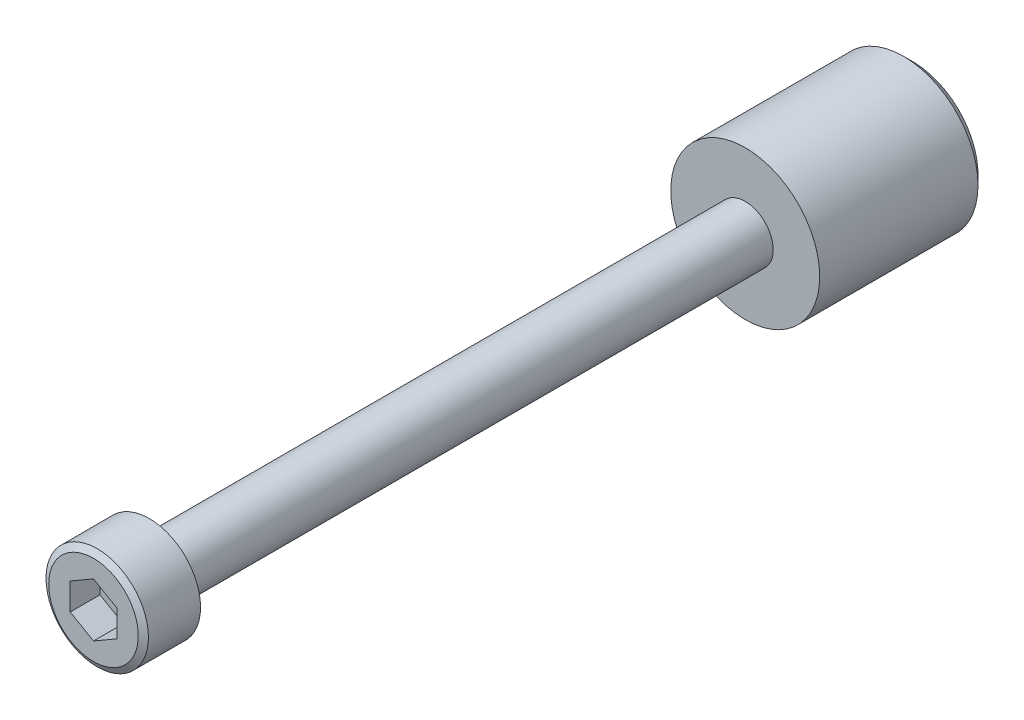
ISO-10303-21;
HEADER;
FILE_DESCRIPTION(('STEP AP214'),'2;1');
FILE_NAME('part.step','',(''),(''),'','','');
FILE_SCHEMA(('AUTOMOTIVE_DESIGN { 1 0 10303 214 1 1 1 1 }'));
ENDSEC;
DATA;
#1=APPLICATION_CONTEXT('core data for automotive mechanical design processes');
#2=APPLICATION_PROTOCOL_DEFINITION('international standard','automotive_design',2000,#1);
#3=PRODUCT_CONTEXT('',#1,'mechanical');
#4=PRODUCT('Part','Part','',(#3));
#5=PRODUCT_RELATED_PRODUCT_CATEGORY('part','',(#4));
#6=PRODUCT_DEFINITION_FORMATION('','',#4);
#7=PRODUCT_DEFINITION_CONTEXT('part definition',#1,'design');
#8=PRODUCT_DEFINITION('design','',#6,#7);
#9=PRODUCT_DEFINITION_SHAPE('','',#8);
#10=(LENGTH_UNIT() NAMED_UNIT(*) SI_UNIT(.MILLI.,.METRE.));
#11=(NAMED_UNIT(*) PLANE_ANGLE_UNIT() SI_UNIT($,.RADIAN.));
#12=(NAMED_UNIT(*) SI_UNIT($,.STERADIAN.) SOLID_ANGLE_UNIT());
#13=UNCERTAINTY_MEASURE_WITH_UNIT(LENGTH_MEASURE(1.E-05),#10,'distance_accuracy_value','');
#14=(GEOMETRIC_REPRESENTATION_CONTEXT(3) GLOBAL_UNCERTAINTY_ASSIGNED_CONTEXT((#13)) GLOBAL_UNIT_ASSIGNED_CONTEXT((#10,
#11,#12)) REPRESENTATION_CONTEXT('',''));
#15=CARTESIAN_POINT('',(0.,0.,0.));
#16=DIRECTION('',(0.,0.,1.));
#17=DIRECTION('',(1.,0.,0.));
#18=AXIS2_PLACEMENT_3D('',#15,#16,#17);
#19=CARTESIAN_POINT('',(4.048,-4.061929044,0.));
#20=DIRECTION('',(0.,0.,-1.));
#21=DIRECTION('',(-1.,0.,0.));
#22=AXIS2_PLACEMENT_3D('',#19,#20,#21);
#23=PLANE('',#22);
#24=CARTESIAN_POINT('',(0.,0.,0.));
#25=DIRECTION('',(0.,0.,-1.));
#26=DIRECTION('',(-1.,0.,0.));
#27=AXIS2_PLACEMENT_3D('',#24,#25,#26);
#28=CIRCLE('',#27,3.5);
#29=CARTESIAN_POINT('',(-3.5,0.,0.));
#30=VERTEX_POINT('',#29);
#31=EDGE_CURVE('E9',#30,#30,#28,.T.);
#32=ORIENTED_EDGE('',*,*,#31,.T.);
#33=EDGE_LOOP('',(#32));
#34=FACE_BOUND('',#33,.T.);
#35=ADVANCED_FACE('F14',(#34),#23,.T.);
#36=CARTESIAN_POINT('',(0.,0.,0.));
#37=DIRECTION('',(0.,0.,1.));
#38=DIRECTION('',(1.,0.,0.));
#39=AXIS2_PLACEMENT_3D('',#36,#37,#38);
#40=CYLINDRICAL_SURFACE('',#39,4.);
#41=CARTESIAN_POINT('',(0.,0.,0.5));
#42=DIRECTION('',(0.,0.,-1.));
#43=DIRECTION('',(-1.,0.,0.));
#44=AXIS2_PLACEMENT_3D('',#41,#42,#43);
#45=CIRCLE('',#44,4.);
#46=CARTESIAN_POINT('',(-4.,0.,0.5));
#47=VERTEX_POINT('',#46);
#48=EDGE_CURVE('E22',#47,#47,#45,.F.);
#49=ORIENTED_EDGE('',*,*,#48,.T.);
#50=EDGE_LOOP('',(#49));
#51=FACE_BOUND('',#50,.T.);
#52=CARTESIAN_POINT('',(0.,0.,9.));
#53=DIRECTION('',(0.,0.,1.));
#54=DIRECTION('',(1.,0.,0.));
#55=AXIS2_PLACEMENT_3D('',#52,#53,#54);
#56=CIRCLE('',#55,4.);
#57=CARTESIAN_POINT('',(4.,0.,9.));
#58=VERTEX_POINT('',#57);
#59=EDGE_CURVE('E116',#58,#58,#56,.T.);
#60=ORIENTED_EDGE('',*,*,#59,.F.);
#61=EDGE_LOOP('',(#60));
#62=FACE_BOUND('',#61,.T.);
#63=ADVANCED_FACE('F141',(#51,#62),#40,.T.);
#64=CARTESIAN_POINT('',(-4.048,-4.061929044,9.));
#65=DIRECTION('',(0.,0.,1.));
#66=DIRECTION('',(1.,0.,0.));
#67=AXIS2_PLACEMENT_3D('',#64,#65,#66);
#68=PLANE('',#67);
#69=CARTESIAN_POINT('',(0.,0.,9.));
#70=DIRECTION('',(0.,0.,1.));
#71=DIRECTION('',(1.,0.,0.));
#72=AXIS2_PLACEMENT_3D('',#69,#70,#71);
#73=CIRCLE('',#72,1.5);
#74=CARTESIAN_POINT('',(1.5,0.,9.));
#75=VERTEX_POINT('',#74);
#76=EDGE_CURVE('E134',#75,#75,#73,.T.);
#77=ORIENTED_EDGE('',*,*,#76,.F.);
#78=EDGE_LOOP('',(#77));
#79=FACE_BOUND('',#78,.T.);
#80=ORIENTED_EDGE('',*,*,#59,.T.);
#81=EDGE_LOOP('',(#80));
#82=FACE_BOUND('',#81,.T.);
#83=ADVANCED_FACE('F176',(#79,#82),#68,.T.);
#84=CARTESIAN_POINT('',(0.,0.,9.));
#85=DIRECTION('',(0.,0.,1.));
#86=DIRECTION('',(1.,0.,0.));
#87=AXIS2_PLACEMENT_3D('',#84,#85,#86);
#88=CYLINDRICAL_SURFACE('',#87,1.5);
#89=ORIENTED_EDGE('',*,*,#76,.T.);
#90=EDGE_LOOP('',(#89));
#91=FACE_BOUND('',#90,.T.);
#92=CARTESIAN_POINT('',(0.,0.,41.));
#93=DIRECTION('',(0.,0.,1.));
#94=DIRECTION('',(1.,0.,0.));
#95=AXIS2_PLACEMENT_3D('',#92,#93,#94);
#96=CIRCLE('',#95,1.5);
#97=CARTESIAN_POINT('',(1.5,0.,41.));
#98=VERTEX_POINT('',#97);
#99=EDGE_CURVE('E131',#98,#98,#96,.T.);
#100=ORIENTED_EDGE('',*,*,#99,.F.);
#101=EDGE_LOOP('',(#100));
#102=FACE_BOUND('',#101,.T.);
#103=ADVANCED_FACE('F179',(#91,#102),#88,.T.);
#104=CARTESIAN_POINT('',(2.783,-2.792576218,41.));
#105=DIRECTION('',(0.,0.,-1.));
#106=DIRECTION('',(-1.,0.,0.));
#107=AXIS2_PLACEMENT_3D('',#104,#105,#106);
#108=PLANE('',#107);
#109=ORIENTED_EDGE('',*,*,#99,.T.);
#110=EDGE_LOOP('',(#109));
#111=FACE_BOUND('',#110,.T.);
#112=CARTESIAN_POINT('',(0.,0.,41.));
#113=DIRECTION('',(0.,0.,1.));
#114=DIRECTION('',(1.,0.,0.));
#115=AXIS2_PLACEMENT_3D('',#112,#113,#114);
#116=CIRCLE('',#115,2.75);
#117=CARTESIAN_POINT('',(2.75,0.,41.));
#118=VERTEX_POINT('',#117);
#119=EDGE_CURVE('E128',#118,#118,#116,.T.);
#120=ORIENTED_EDGE('',*,*,#119,.F.);
#121=EDGE_LOOP('',(#120));
#122=FACE_BOUND('',#121,.T.);
#123=ADVANCED_FACE('F181',(#111,#122),#108,.T.);
#124=CARTESIAN_POINT('',(-2.432432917,-2.440802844,44.));
#125=DIRECTION('',(0.,0.,1.));
#126=DIRECTION('',(1.,0.,0.));
#127=AXIS2_PLACEMENT_3D('',#124,#125,#126);
#128=PLANE('',#127);
#129=DIRECTION('',(-0.866025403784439,0.5,0.));
#130=VECTOR('',#129,1.);
#131=CARTESIAN_POINT('',(1.25,0.721687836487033,44.));
#132=LINE('',#131,#130);
#133=CARTESIAN_POINT('',(1.25,0.721687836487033,44.));
#134=VERTEX_POINT('',#133);
#135=CARTESIAN_POINT('',(0.,1.44337567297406,44.));
#136=VERTEX_POINT('',#135);
#137=EDGE_CURVE('E29',#134,#136,#132,.T.);
#138=ORIENTED_EDGE('',*,*,#137,.F.);
#139=DIRECTION('',(0.,1.,0.));
#140=VECTOR('',#139,1.);
#141=CARTESIAN_POINT('',(1.25,-0.721687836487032,44.));
#142=LINE('',#141,#140);
#143=CARTESIAN_POINT('',(1.25,-0.721687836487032,44.));
#144=VERTEX_POINT('',#143);
#145=EDGE_CURVE('E112',#144,#134,#142,.T.);
#146=ORIENTED_EDGE('',*,*,#145,.F.);
#147=DIRECTION('',(0.866025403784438,0.5,0.));
#148=VECTOR('',#147,1.);
#149=CARTESIAN_POINT('',(0.,-1.44337567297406,44.));
#150=LINE('',#149,#148);
#151=CARTESIAN_POINT('',(0.,-1.44337567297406,44.));
#152=VERTEX_POINT('',#151);
#153=EDGE_CURVE('E110',#152,#144,#150,.T.);
#154=ORIENTED_EDGE('',*,*,#153,.F.);
#155=DIRECTION('',(0.866025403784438,-0.5,0.));
#156=VECTOR('',#155,1.);
#157=CARTESIAN_POINT('',(-1.25,-0.721687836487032,44.));
#158=LINE('',#157,#156);
#159=CARTESIAN_POINT('',(-1.25,-0.721687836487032,44.));
#160=VERTEX_POINT('',#159);
#161=EDGE_CURVE('E77',#160,#152,#158,.T.);
#162=ORIENTED_EDGE('',*,*,#161,.F.);
#163=DIRECTION('',(0.,-1.,0.));
#164=VECTOR('',#163,1.);
#165=CARTESIAN_POINT('',(-1.25,0.721687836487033,44.));
#166=LINE('',#165,#164);
#167=CARTESIAN_POINT('',(-1.25,0.721687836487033,44.));
#168=VERTEX_POINT('',#167);
#169=EDGE_CURVE('E106',#168,#160,#166,.T.);
#170=ORIENTED_EDGE('',*,*,#169,.F.);
#171=DIRECTION('',(-0.866025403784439,-0.5,0.));
#172=VECTOR('',#171,1.);
#173=CARTESIAN_POINT('',(0.,1.44337567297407,44.));
#174=LINE('',#173,#172);
#175=EDGE_CURVE('E103',#136,#168,#174,.T.);
#176=ORIENTED_EDGE('',*,*,#175,.F.);
#177=EDGE_LOOP('',(#138,#146,#154,#162,#170,#176));
#178=FACE_BOUND('',#177,.T.);
#179=CARTESIAN_POINT('',(0.,0.,44.));
#180=DIRECTION('',(0.,0.,-1.));
#181=DIRECTION('',(-1.,0.,0.));
#182=AXIS2_PLACEMENT_3D('',#179,#180,#181);
#183=CIRCLE('',#182,2.403589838);
#184=CARTESIAN_POINT('',(-2.403589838,0.,44.));
#185=VERTEX_POINT('',#184);
#186=EDGE_CURVE('E125',#185,#185,#183,.T.);
#187=ORIENTED_EDGE('',*,*,#186,.F.);
#188=EDGE_LOOP('',(#187));
#189=FACE_BOUND('',#188,.T.);
#190=ADVANCED_FACE('F167',(#178,#189),#128,.T.);
#191=CARTESIAN_POINT('',(0.,0.,41.));
#192=DIRECTION('',(0.,0.,1.));
#193=DIRECTION('',(1.,0.,0.));
#194=AXIS2_PLACEMENT_3D('',#191,#192,#193);
#195=CYLINDRICAL_SURFACE('',#194,2.75);
#196=CARTESIAN_POINT('',(0.,0.,43.8));
#197=DIRECTION('',(0.,0.,-1.));
#198=DIRECTION('',(-1.,0.,0.));
#199=AXIS2_PLACEMENT_3D('',#196,#197,#198);
#200=CIRCLE('',#199,2.75);
#201=CARTESIAN_POINT('',(-2.75,0.,43.8));
#202=VERTEX_POINT('',#201);
#203=EDGE_CURVE('E122',#202,#202,#200,.F.);
#204=ORIENTED_EDGE('',*,*,#203,.F.);
#205=EDGE_LOOP('',(#204));
#206=FACE_BOUND('',#205,.T.);
#207=ORIENTED_EDGE('',*,*,#119,.T.);
#208=EDGE_LOOP('',(#207));
#209=FACE_BOUND('',#208,.T.);
#210=ADVANCED_FACE('F157',(#206,#209),#195,.T.);
#211=CARTESIAN_POINT('',(0.,0.,44.));
#212=DIRECTION('',(0.,0.,-1.));
#213=DIRECTION('',(-1.,0.,0.));
#214=AXIS2_PLACEMENT_3D('',#211,#212,#213);
#215=CONICAL_SURFACE('',#214,2.403589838,1.04719755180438);
#216=ORIENTED_EDGE('',*,*,#203,.T.);
#217=EDGE_LOOP('',(#216));
#218=FACE_BOUND('',#217,.T.);
#219=ORIENTED_EDGE('',*,*,#186,.T.);
#220=EDGE_LOOP('',(#219));
#221=FACE_BOUND('',#220,.T.);
#222=ADVANCED_FACE('F154',(#218,#221),#215,.T.);
#223=CARTESIAN_POINT('',(1.25,0.721687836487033,42.4));
#224=DIRECTION('',(0.5,0.866025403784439,0.));
#225=DIRECTION('',(-0.866025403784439,0.5,0.));
#226=AXIS2_PLACEMENT_3D('',#223,#224,#225);
#227=PLANE('',#226);
#228=ORIENTED_EDGE('',*,*,#137,.T.);
#229=DIRECTION('',(0.,0.,1.));
#230=VECTOR('',#229,1.);
#231=CARTESIAN_POINT('',(0.,1.44337567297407,42.4));
#232=LINE('',#231,#230);
#233=CARTESIAN_POINT('',(0.,1.44337567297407,42.4));
#234=VERTEX_POINT('',#233);
#235=EDGE_CURVE('E59',#234,#136,#232,.T.);
#236=ORIENTED_EDGE('',*,*,#235,.F.);
#237=DIRECTION('',(-0.866025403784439,0.5,0.));
#238=VECTOR('',#237,1.);
#239=CARTESIAN_POINT('',(1.25,0.721687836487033,42.4));
#240=LINE('',#239,#238);
#241=CARTESIAN_POINT('',(1.25,0.721687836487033,42.4));
#242=VERTEX_POINT('',#241);
#243=EDGE_CURVE('E114',#242,#234,#240,.T.);
#244=ORIENTED_EDGE('',*,*,#243,.F.);
#245=DIRECTION('',(0.,0.,1.));
#246=VECTOR('',#245,1.);
#247=CARTESIAN_POINT('',(1.25,0.721687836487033,42.4));
#248=LINE('',#247,#246);
#249=EDGE_CURVE('E37',#242,#134,#248,.T.);
#250=ORIENTED_EDGE('',*,*,#249,.T.);
#251=EDGE_LOOP('',(#228,#236,#244,#250));
#252=FACE_BOUND('',#251,.T.);
#253=ADVANCED_FACE('F156',(#252),#227,.F.);
#254=CARTESIAN_POINT('',(1.25,-0.721687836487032,42.4));
#255=DIRECTION('',(1.,0.,0.));
#256=DIRECTION('',(0.,0.,-1.));
#257=AXIS2_PLACEMENT_3D('',#254,#255,#256);
#258=PLANE('',#257);
#259=ORIENTED_EDGE('',*,*,#145,.T.);
#260=ORIENTED_EDGE('',*,*,#249,.F.);
#261=DIRECTION('',(0.,1.,0.));
#262=VECTOR('',#261,1.);
#263=CARTESIAN_POINT('',(1.25,-0.721687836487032,42.4));
#264=LINE('',#263,#262);
#265=CARTESIAN_POINT('',(1.25,-0.721687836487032,42.4));
#266=VERTEX_POINT('',#265);
#267=EDGE_CURVE('E89',#266,#242,#264,.T.);
#268=ORIENTED_EDGE('',*,*,#267,.F.);
#269=DIRECTION('',(0.,0.,1.));
#270=VECTOR('',#269,1.);
#271=CARTESIAN_POINT('',(1.25,-0.721687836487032,42.4));
#272=LINE('',#271,#270);
#273=EDGE_CURVE('E81',#266,#144,#272,.T.);
#274=ORIENTED_EDGE('',*,*,#273,.T.);
#275=EDGE_LOOP('',(#259,#260,#268,#274));
#276=FACE_BOUND('',#275,.T.);
#277=ADVANCED_FACE('F165',(#276),#258,.F.);
#278=CARTESIAN_POINT('',(0.,-1.44337567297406,42.4));
#279=DIRECTION('',(0.5,-0.866025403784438,0.));
#280=DIRECTION('',(0.866025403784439,0.5,0.));
#281=AXIS2_PLACEMENT_3D('',#278,#279,#280);
#282=PLANE('',#281);
#283=ORIENTED_EDGE('',*,*,#153,.T.);
#284=ORIENTED_EDGE('',*,*,#273,.F.);
#285=DIRECTION('',(0.866025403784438,0.5,0.));
#286=VECTOR('',#285,1.);
#287=CARTESIAN_POINT('',(0.,-1.44337567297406,42.4));
#288=LINE('',#287,#286);
#289=CARTESIAN_POINT('',(0.,-1.44337567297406,42.4));
#290=VERTEX_POINT('',#289);
#291=EDGE_CURVE('E85',#290,#266,#288,.T.);
#292=ORIENTED_EDGE('',*,*,#291,.F.);
#293=DIRECTION('',(0.,0.,1.));
#294=VECTOR('',#293,1.);
#295=CARTESIAN_POINT('',(0.,-1.44337567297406,42.4));
#296=LINE('',#295,#294);
#297=EDGE_CURVE('E70',#290,#152,#296,.T.);
#298=ORIENTED_EDGE('',*,*,#297,.T.);
#299=EDGE_LOOP('',(#283,#284,#292,#298));
#300=FACE_BOUND('',#299,.T.);
#301=ADVANCED_FACE('F86',(#300),#282,.F.);
#302=CARTESIAN_POINT('',(-1.25,-0.721687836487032,42.4));
#303=DIRECTION('',(-0.5,-0.866025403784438,0.));
#304=DIRECTION('',(0.866025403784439,-0.5,0.));
#305=AXIS2_PLACEMENT_3D('',#302,#303,#304);
#306=PLANE('',#305);
#307=ORIENTED_EDGE('',*,*,#161,.T.);
#308=ORIENTED_EDGE('',*,*,#297,.F.);
#309=DIRECTION('',(0.866025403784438,-0.5,0.));
#310=VECTOR('',#309,1.);
#311=CARTESIAN_POINT('',(-1.25,-0.721687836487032,42.4));
#312=LINE('',#311,#310);
#313=CARTESIAN_POINT('',(-1.25,-0.721687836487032,42.4));
#314=VERTEX_POINT('',#313);
#315=EDGE_CURVE('E74',#314,#290,#312,.T.);
#316=ORIENTED_EDGE('',*,*,#315,.F.);
#317=DIRECTION('',(0.,0.,1.));
#318=VECTOR('',#317,1.);
#319=CARTESIAN_POINT('',(-1.25,-0.721687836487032,42.4));
#320=LINE('',#319,#318);
#321=EDGE_CURVE('E82',#314,#160,#320,.T.);
#322=ORIENTED_EDGE('',*,*,#321,.T.);
#323=EDGE_LOOP('',(#307,#308,#316,#322));
#324=FACE_BOUND('',#323,.T.);
#325=ADVANCED_FACE('F72',(#324),#306,.F.);
#326=CARTESIAN_POINT('',(-1.25,0.721687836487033,42.4));
#327=DIRECTION('',(-1.,0.,0.));
#328=DIRECTION('',(0.,-1.,0.));
#329=AXIS2_PLACEMENT_3D('',#326,#327,#328);
#330=PLANE('',#329);
#331=ORIENTED_EDGE('',*,*,#169,.T.);
#332=ORIENTED_EDGE('',*,*,#321,.F.);
#333=DIRECTION('',(0.,-1.,0.));
#334=VECTOR('',#333,1.);
#335=CARTESIAN_POINT('',(-1.25,0.721687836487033,42.4));
#336=LINE('',#335,#334);
#337=CARTESIAN_POINT('',(-1.25,0.721687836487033,42.4));
#338=VERTEX_POINT('',#337);
#339=EDGE_CURVE('E95',#338,#314,#336,.T.);
#340=ORIENTED_EDGE('',*,*,#339,.F.);
#341=DIRECTION('',(0.,0.,1.));
#342=VECTOR('',#341,1.);
#343=CARTESIAN_POINT('',(-1.25,0.721687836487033,42.4));
#344=LINE('',#343,#342);
#345=EDGE_CURVE('E119',#338,#168,#344,.T.);
#346=ORIENTED_EDGE('',*,*,#345,.T.);
#347=EDGE_LOOP('',(#331,#332,#340,#346));
#348=FACE_BOUND('',#347,.T.);
#349=ADVANCED_FACE('F206',(#348),#330,.F.);
#350=CARTESIAN_POINT('',(0.,1.44337567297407,42.4));
#351=DIRECTION('',(-0.5,0.866025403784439,0.));
#352=DIRECTION('',(-0.866025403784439,-0.5,0.));
#353=AXIS2_PLACEMENT_3D('',#350,#351,#352);
#354=PLANE('',#353);
#355=ORIENTED_EDGE('',*,*,#175,.T.);
#356=ORIENTED_EDGE('',*,*,#345,.F.);
#357=DIRECTION('',(-0.866025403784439,-0.5,0.));
#358=VECTOR('',#357,1.);
#359=CARTESIAN_POINT('',(0.,1.44337567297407,42.4));
#360=LINE('',#359,#358);
#361=EDGE_CURVE('E97',#234,#338,#360,.T.);
#362=ORIENTED_EDGE('',*,*,#361,.F.);
#363=ORIENTED_EDGE('',*,*,#235,.T.);
#364=EDGE_LOOP('',(#355,#356,#362,#363));
#365=FACE_BOUND('',#364,.T.);
#366=ADVANCED_FACE('F151',(#365),#354,.F.);
#367=CARTESIAN_POINT('',(0.,1.44337567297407,42.4));
#368=DIRECTION('',(0.,0.,1.));
#369=DIRECTION('',(1.,0.,0.));
#370=AXIS2_PLACEMENT_3D('',#367,#368,#369);
#371=PLANE('',#370);
#372=ORIENTED_EDGE('',*,*,#243,.T.);
#373=ORIENTED_EDGE('',*,*,#361,.T.);
#374=ORIENTED_EDGE('',*,*,#339,.T.);
#375=ORIENTED_EDGE('',*,*,#315,.T.);
#376=ORIENTED_EDGE('',*,*,#291,.T.);
#377=ORIENTED_EDGE('',*,*,#267,.T.);
#378=EDGE_LOOP('',(#372,#373,#374,#375,#376,#377));
#379=FACE_BOUND('',#378,.T.);
#380=ADVANCED_FACE('F92',(#379),#371,.T.);
#381=CARTESIAN_POINT('',(0.,0.,0.5));
#382=DIRECTION('',(0.,0.,1.));
#383=DIRECTION('',(1.,0.,0.));
#384=AXIS2_PLACEMENT_3D('',#381,#382,#383);
#385=CONICAL_SURFACE('',#384,4.,0.785398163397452);
#386=ORIENTED_EDGE('',*,*,#31,.F.);
#387=EDGE_LOOP('',(#386));
#388=FACE_BOUND('',#387,.T.);
#389=ORIENTED_EDGE('',*,*,#48,.F.);
#390=EDGE_LOOP('',(#389));
#391=FACE_BOUND('',#390,.T.);
#392=ADVANCED_FACE('F16',(#388,#391),#385,.T.);
#393=CLOSED_SHELL('',(#35,#63,#83,#103,#123,#190,#210,#222,#253,#277,#301,#325,#349,#366,#380,#392));
#394=MANIFOLD_SOLID_BREP('B1',#393);
#395=ADVANCED_BREP_SHAPE_REPRESENTATION('',(#18,#394),#14);
#396=SHAPE_DEFINITION_REPRESENTATION(#9,#395);
ENDSEC;
END-ISO-10303-21;
